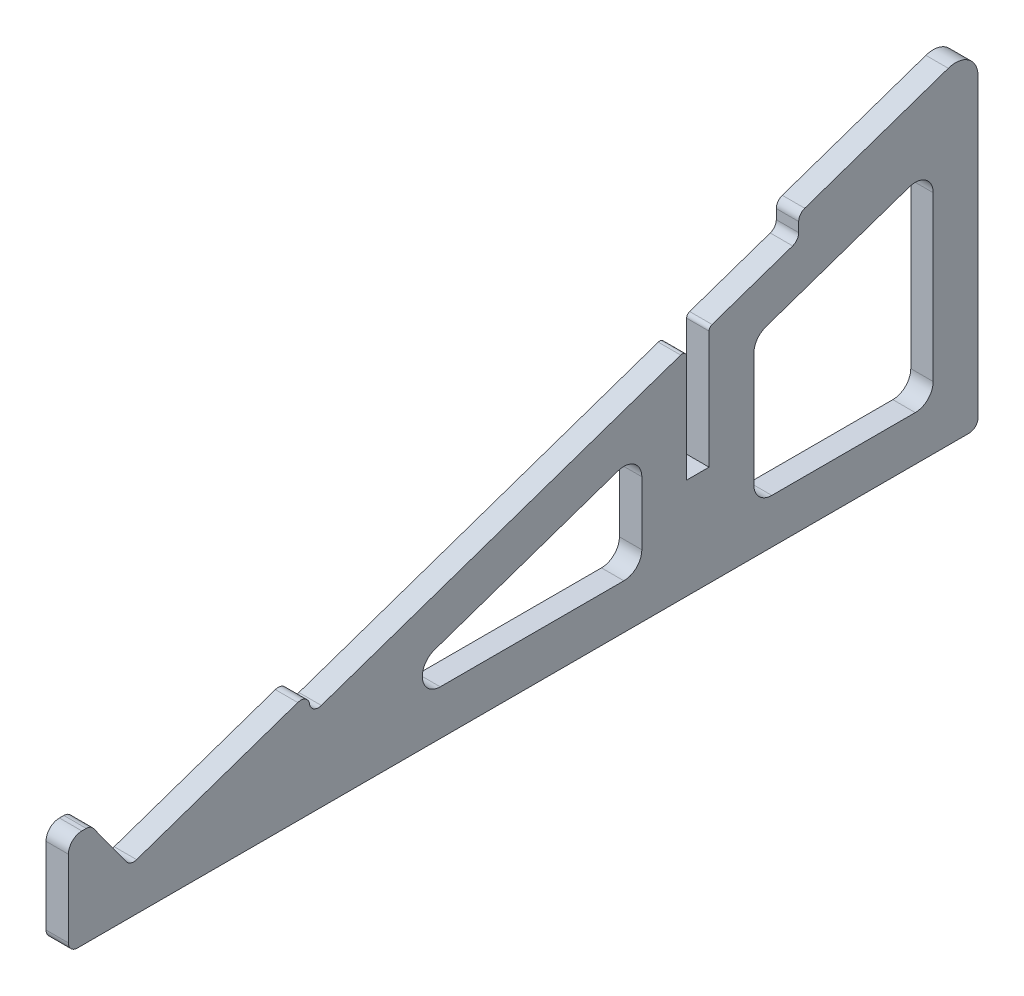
ISO-10303-21;
HEADER;
FILE_DESCRIPTION(('STEP AP214'),'2;1');
FILE_NAME('part.step','',(''),(''),'','','');
FILE_SCHEMA(('AUTOMOTIVE_DESIGN { 1 0 10303 214 1 1 1 1 }'));
ENDSEC;
DATA;
#1=APPLICATION_CONTEXT('core data for automotive mechanical design processes');
#2=APPLICATION_PROTOCOL_DEFINITION('international standard','automotive_design',2000,#1);
#3=PRODUCT_CONTEXT('',#1,'mechanical');
#4=PRODUCT('Part','Part','',(#3));
#5=PRODUCT_RELATED_PRODUCT_CATEGORY('part','',(#4));
#6=PRODUCT_DEFINITION_FORMATION('','',#4);
#7=PRODUCT_DEFINITION_CONTEXT('part definition',#1,'design');
#8=PRODUCT_DEFINITION('design','',#6,#7);
#9=PRODUCT_DEFINITION_SHAPE('','',#8);
#10=(LENGTH_UNIT() NAMED_UNIT(*) SI_UNIT(.MILLI.,.METRE.));
#11=(NAMED_UNIT(*) PLANE_ANGLE_UNIT() SI_UNIT($,.RADIAN.));
#12=(NAMED_UNIT(*) SI_UNIT($,.STERADIAN.) SOLID_ANGLE_UNIT());
#13=UNCERTAINTY_MEASURE_WITH_UNIT(LENGTH_MEASURE(1.E-05),#10,'distance_accuracy_value','');
#14=(GEOMETRIC_REPRESENTATION_CONTEXT(3) GLOBAL_UNCERTAINTY_ASSIGNED_CONTEXT((#13)) GLOBAL_UNIT_ASSIGNED_CONTEXT((#10,
#11,#12)) REPRESENTATION_CONTEXT('',''));
#15=CARTESIAN_POINT('',(0.,0.,0.));
#16=DIRECTION('',(0.,0.,1.));
#17=DIRECTION('',(1.,0.,0.));
#18=AXIS2_PLACEMENT_3D('',#15,#16,#17);
#19=CARTESIAN_POINT('',(0.,71.5524684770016,-78.0545136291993));
#20=DIRECTION('',(0.,-0.945518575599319,-0.325568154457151));
#21=DIRECTION('',(0.,0.325568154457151,-0.945518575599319));
#22=AXIS2_PLACEMENT_3D('',#19,#20,#21);
#23=PLANE('',#22);
#24=DIRECTION('',(0.,0.325568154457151,-0.945518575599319));
#25=VECTOR('',#24,1.);
#26=CARTESIAN_POINT('',(0.,71.5524684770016,-78.0545136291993));
#27=LINE('',#26,#25);
#28=CARTESIAN_POINT('',(0.,63.1014734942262,-53.5110420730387));
#29=VERTEX_POINT('',#28);
#30=CARTESIAN_POINT('',(0.,70.9626156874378,-76.3414567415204));
#31=VERTEX_POINT('',#30);
#32=EDGE_CURVE('E323',#29,#31,#27,.T.);
#33=ORIENTED_EDGE('',*,*,#32,.F.);
#34=DIRECTION('',(1.,0.,0.));
#35=VECTOR('',#34,1.);
#36=CARTESIAN_POINT('',(0.,63.1014734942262,-53.5110420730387));
#37=LINE('',#36,#35);
#38=CARTESIAN_POINT('',(6.35,63.1014734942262,-53.5110420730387));
#39=VERTEX_POINT('',#38);
#40=EDGE_CURVE('E521',#29,#39,#37,.T.);
#41=ORIENTED_EDGE('',*,*,#40,.T.);
#42=DIRECTION('',(0.,0.325568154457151,-0.945518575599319));
#43=VECTOR('',#42,1.);
#44=CARTESIAN_POINT('',(6.35,71.5524684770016,-78.0545136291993));
#45=LINE('',#44,#43);
#46=CARTESIAN_POINT('',(6.35,70.9626156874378,-76.3414567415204));
#47=VERTEX_POINT('',#46);
#48=EDGE_CURVE('E318',#39,#47,#45,.T.);
#49=ORIENTED_EDGE('',*,*,#48,.T.);
#50=DIRECTION('',(1.,0.,0.));
#51=VECTOR('',#50,1.);
#52=CARTESIAN_POINT('',(0.,70.9626156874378,-76.3414567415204));
#53=LINE('',#52,#51);
#54=EDGE_CURVE('E422',#47,#31,#53,.F.);
#55=ORIENTED_EDGE('',*,*,#54,.T.);
#56=EDGE_LOOP('',(#33,#41,#49,#55));
#57=FACE_BOUND('',#56,.T.);
#58=ADVANCED_FACE('F35',(#57),#23,.F.);
#59=CARTESIAN_POINT('',(6.35,95.3943112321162,-128.854513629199));
#60=DIRECTION('',(0.,-0.945518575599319,-0.32556815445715));
#61=DIRECTION('',(0.,0.32556815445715,-0.945518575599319));
#62=AXIS2_PLACEMENT_3D('',#59,#60,#61);
#63=PLANE('',#62);
#64=DIRECTION('',(0.,-0.32556815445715,0.945518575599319));
#65=VECTOR('',#64,1.);
#66=CARTESIAN_POINT('',(6.35,95.3943112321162,-128.854513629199));
#67=LINE('',#66,#65);
#68=CARTESIAN_POINT('',(6.35,92.4959825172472,-120.437155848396));
#69=VERTEX_POINT('',#68);
#70=CARTESIAN_POINT('',(6.35,78.4923212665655,-79.7675705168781));
#71=VERTEX_POINT('',#70);
#72=EDGE_CURVE('E340',#69,#71,#67,.T.);
#73=ORIENTED_EDGE('',*,*,#72,.F.);
#74=DIRECTION('',(-1.,0.,0.));
#75=VECTOR('',#74,1.);
#76=CARTESIAN_POINT('',(6.35,92.4959825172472,-120.437155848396));
#77=LINE('',#76,#75);
#78=CARTESIAN_POINT('',(0.,92.4959825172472,-120.437155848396));
#79=VERTEX_POINT('',#78);
#80=EDGE_CURVE('E449',#69,#79,#77,.T.);
#81=ORIENTED_EDGE('',*,*,#80,.T.);
#82=DIRECTION('',(0.,-0.32556815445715,0.945518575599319));
#83=VECTOR('',#82,1.);
#84=CARTESIAN_POINT('',(0.,95.3943112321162,-128.854513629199));
#85=LINE('',#84,#83);
#86=CARTESIAN_POINT('',(0.,78.4923212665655,-79.7675705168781));
#87=VERTEX_POINT('',#86);
#88=EDGE_CURVE('E357',#79,#87,#85,.T.);
#89=ORIENTED_EDGE('',*,*,#88,.T.);
#90=DIRECTION('',(1.,0.,0.));
#91=VECTOR('',#90,1.);
#92=CARTESIAN_POINT('',(6.35,78.4923212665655,-79.7675705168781));
#93=LINE('',#92,#91);
#94=EDGE_CURVE('E348',#87,#71,#93,.T.);
#95=ORIENTED_EDGE('',*,*,#94,.T.);
#96=EDGE_LOOP('',(#73,#81,#89,#95));
#97=FACE_BOUND('',#96,.T.);
#98=ADVANCED_FACE('F566',(#97),#63,.F.);
#99=CARTESIAN_POINT('',(6.35,0.,128.854513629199));
#100=DIRECTION('',(0.,0.,-1.));
#101=DIRECTION('',(0.,1.,0.));
#102=AXIS2_PLACEMENT_3D('',#99,#100,#101);
#103=PLANE('',#102);
#104=DIRECTION('',(0.,-1.,0.));
#105=VECTOR('',#104,1.);
#106=CARTESIAN_POINT('',(6.35,0.,128.854513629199));
#107=LINE('',#106,#105);
#108=CARTESIAN_POINT('',(6.35,24.3017737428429,128.854513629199));
#109=VERTEX_POINT('',#108);
#110=CARTESIAN_POINT('',(6.35,2.54,128.854513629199));
#111=VERTEX_POINT('',#110);
#112=EDGE_CURVE('E330',#109,#111,#107,.T.);
#113=ORIENTED_EDGE('',*,*,#112,.F.);
#114=DIRECTION('',(-1.,0.,0.));
#115=VECTOR('',#114,1.);
#116=CARTESIAN_POINT('',(6.35,24.3017737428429,128.854513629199));
#117=LINE('',#116,#115);
#118=CARTESIAN_POINT('',(0.,24.3017737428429,128.854513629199));
#119=VERTEX_POINT('',#118);
#120=EDGE_CURVE('E440',#109,#119,#117,.T.);
#121=ORIENTED_EDGE('',*,*,#120,.T.);
#122=DIRECTION('',(0.,-1.,0.));
#123=VECTOR('',#122,1.);
#124=CARTESIAN_POINT('',(0.,0.,128.854513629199));
#125=LINE('',#124,#123);
#126=CARTESIAN_POINT('',(0.,2.54,128.854513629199));
#127=VERTEX_POINT('',#126);
#128=EDGE_CURVE('E325',#119,#127,#125,.T.);
#129=ORIENTED_EDGE('',*,*,#128,.T.);
#130=DIRECTION('',(-1.,0.,0.));
#131=VECTOR('',#130,1.);
#132=CARTESIAN_POINT('',(6.35,2.54,128.854513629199));
#133=LINE('',#132,#131);
#134=EDGE_CURVE('E403',#127,#111,#133,.F.);
#135=ORIENTED_EDGE('',*,*,#134,.T.);
#136=EDGE_LOOP('',(#113,#121,#129,#135));
#137=FACE_BOUND('',#136,.T.);
#138=ADVANCED_FACE('F593',(#137),#103,.F.);
#139=CARTESIAN_POINT('',(6.35,0.,128.854513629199));
#140=DIRECTION('',(0.,1.,0.));
#141=DIRECTION('',(0.,0.,1.));
#142=AXIS2_PLACEMENT_3D('',#139,#140,#141);
#143=PLANE('',#142);
#144=DIRECTION('',(0.,0.,-1.));
#145=VECTOR('',#144,1.);
#146=CARTESIAN_POINT('',(0.,0.,128.854513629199));
#147=LINE('',#146,#145);
#148=CARTESIAN_POINT('',(0.,0.,126.314513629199));
#149=VERTEX_POINT('',#148);
#150=CARTESIAN_POINT('',(0.,0.,-126.314513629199));
#151=VERTEX_POINT('',#150);
#152=EDGE_CURVE('E350',#149,#151,#147,.T.);
#153=ORIENTED_EDGE('',*,*,#152,.T.);
#154=DIRECTION('',(-1.,0.,0.));
#155=VECTOR('',#154,1.);
#156=CARTESIAN_POINT('',(6.35,0.,-126.314513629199));
#157=LINE('',#156,#155);
#158=CARTESIAN_POINT('',(6.35,0.,-126.314513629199));
#159=VERTEX_POINT('',#158);
#160=EDGE_CURVE('E395',#151,#159,#157,.F.);
#161=ORIENTED_EDGE('',*,*,#160,.T.);
#162=DIRECTION('',(0.,0.,-1.));
#163=VECTOR('',#162,1.);
#164=CARTESIAN_POINT('',(6.35,0.,128.854513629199));
#165=LINE('',#164,#163);
#166=CARTESIAN_POINT('',(6.35,0.,126.314513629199));
#167=VERTEX_POINT('',#166);
#168=EDGE_CURVE('E332',#167,#159,#165,.T.);
#169=ORIENTED_EDGE('',*,*,#168,.F.);
#170=DIRECTION('',(-1.,0.,0.));
#171=VECTOR('',#170,1.);
#172=CARTESIAN_POINT('',(6.35,0.,126.314513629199));
#173=LINE('',#172,#171);
#174=EDGE_CURVE('E392',#167,#149,#173,.T.);
#175=ORIENTED_EDGE('',*,*,#174,.T.);
#176=EDGE_LOOP('',(#153,#161,#169,#175));
#177=FACE_BOUND('',#176,.T.);
#178=ADVANCED_FACE('F583',(#177),#143,.F.);
#179=CARTESIAN_POINT('',(6.35,0.,-128.854513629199));
#180=DIRECTION('',(0.,0.,1.));
#181=DIRECTION('',(0.,-1.,0.));
#182=AXIS2_PLACEMENT_3D('',#179,#180,#181);
#183=PLANE('',#182);
#184=DIRECTION('',(0.,1.,0.));
#185=VECTOR('',#184,1.);
#186=CARTESIAN_POINT('',(0.,0.,-128.854513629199));
#187=LINE('',#186,#185);
#188=CARTESIAN_POINT('',(0.,2.54,-128.854513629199));
#189=VERTEX_POINT('',#188);
#190=CARTESIAN_POINT('',(0.,86.4919395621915,-128.854513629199));
#191=VERTEX_POINT('',#190);
#192=EDGE_CURVE('E353',#189,#191,#187,.T.);
#193=ORIENTED_EDGE('',*,*,#192,.T.);
#194=DIRECTION('',(-1.,0.,0.));
#195=VECTOR('',#194,1.);
#196=CARTESIAN_POINT('',(6.35,86.4919395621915,-128.854513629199));
#197=LINE('',#196,#195);
#198=CARTESIAN_POINT('',(6.35,86.4919395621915,-128.854513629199));
#199=VERTEX_POINT('',#198);
#200=EDGE_CURVE('E454',#191,#199,#197,.F.);
#201=ORIENTED_EDGE('',*,*,#200,.T.);
#202=DIRECTION('',(0.,1.,0.));
#203=VECTOR('',#202,1.);
#204=CARTESIAN_POINT('',(6.35,0.,-128.854513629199));
#205=LINE('',#204,#203);
#206=CARTESIAN_POINT('',(6.35,2.54,-128.854513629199));
#207=VERTEX_POINT('',#206);
#208=EDGE_CURVE('E336',#207,#199,#205,.T.);
#209=ORIENTED_EDGE('',*,*,#208,.F.);
#210=DIRECTION('',(-1.,0.,0.));
#211=VECTOR('',#210,1.);
#212=CARTESIAN_POINT('',(6.35,2.54,-128.854513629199));
#213=LINE('',#212,#211);
#214=EDGE_CURVE('E382',#207,#189,#213,.T.);
#215=ORIENTED_EDGE('',*,*,#214,.T.);
#216=EDGE_LOOP('',(#193,#201,#209,#215));
#217=FACE_BOUND('',#216,.T.);
#218=ADVANCED_FACE('F574',(#217),#183,.F.);
#219=CARTESIAN_POINT('',(0.,29.032511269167,63.874147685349));
#220=VERTEX_POINT('',#219);
#221=CARTESIAN_POINT('',(0.,13.3119057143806,109.530101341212));
#222=VERTEX_POINT('',#221);
#223=EDGE_CURVE('E356',#220,#222,#85,.T.);
#224=ORIENTED_EDGE('',*,*,#223,.T.);
#225=DIRECTION('',(-1.,0.,0.));
#226=VECTOR('',#225,1.);
#227=CARTESIAN_POINT('',(6.35,13.3119057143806,109.530101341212));
#228=LINE('',#227,#226);
#229=CARTESIAN_POINT('',(6.35,13.3119057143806,109.530101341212));
#230=VERTEX_POINT('',#229);
#231=EDGE_CURVE('E414',#222,#230,#228,.F.);
#232=ORIENTED_EDGE('',*,*,#231,.T.);
#233=CARTESIAN_POINT('',(6.35,29.032511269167,63.874147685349));
#234=VERTEX_POINT('',#233);
#235=EDGE_CURVE('E339',#234,#230,#67,.T.);
#236=ORIENTED_EDGE('',*,*,#235,.F.);
#237=DIRECTION('',(1.,0.,0.));
#238=VECTOR('',#237,1.);
#239=CARTESIAN_POINT('',(6.35,29.032511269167,63.8741476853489));
#240=LINE('',#239,#238);
#241=EDGE_CURVE('E380',#234,#220,#240,.F.);
#242=ORIENTED_EDGE('',*,*,#241,.T.);
#243=EDGE_LOOP('',(#224,#232,#236,#242));
#244=FACE_BOUND('',#243,.T.);
#245=ADVANCED_FACE('F620',(#244),#63,.F.);
#246=CARTESIAN_POINT('',(6.35,12.7,111.307204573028));
#247=DIRECTION('',(0.,-0.587785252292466,0.809016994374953));
#248=DIRECTION('',(0.,-0.809016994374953,-0.587785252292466));
#249=AXIS2_PLACEMENT_3D('',#246,#247,#248);
#250=PLANE('',#249);
#251=DIRECTION('',(0.,0.809016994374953,0.587785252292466));
#252=VECTOR('',#251,1.);
#253=CARTESIAN_POINT('',(0.,12.7,111.307204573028));
#254=LINE('',#253,#252);
#255=CARTESIAN_POINT('',(0.,14.22054835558,112.411947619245));
#256=VERTEX_POINT('',#255);
#257=CARTESIAN_POINT('',(0.,27.0647482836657,121.743805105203));
#258=VERTEX_POINT('',#257);
#259=EDGE_CURVE('E359',#256,#258,#254,.T.);
#260=ORIENTED_EDGE('',*,*,#259,.T.);
#261=DIRECTION('',(-1.,0.,0.));
#262=VECTOR('',#261,1.);
#263=CARTESIAN_POINT('',(6.35,27.0647482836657,121.743805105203));
#264=LINE('',#263,#262);
#265=CARTESIAN_POINT('',(6.35,27.0647482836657,121.743805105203));
#266=VERTEX_POINT('',#265);
#267=EDGE_CURVE('E412',#258,#266,#264,.F.);
#268=ORIENTED_EDGE('',*,*,#267,.T.);
#269=DIRECTION('',(0.,0.809016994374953,0.587785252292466));
#270=VECTOR('',#269,1.);
#271=CARTESIAN_POINT('',(6.35,12.7,111.307204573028));
#272=LINE('',#271,#270);
#273=CARTESIAN_POINT('',(6.35,14.22054835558,112.411947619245));
#274=VERTEX_POINT('',#273);
#275=EDGE_CURVE('E342',#274,#266,#272,.T.);
#276=ORIENTED_EDGE('',*,*,#275,.F.);
#277=DIRECTION('',(-1.,0.,0.));
#278=VECTOR('',#277,1.);
#279=CARTESIAN_POINT('',(0.,14.22054835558,112.411947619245));
#280=LINE('',#279,#278);
#281=EDGE_CURVE('E409',#274,#256,#280,.T.);
#282=ORIENTED_EDGE('',*,*,#281,.T.);
#283=EDGE_LOOP('',(#260,#268,#276,#282));
#284=FACE_BOUND('',#283,.T.);
#285=ADVANCED_FACE('F610',(#284),#250,.F.);
#286=CARTESIAN_POINT('',(6.35,28.1117737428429,122.504513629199));
#287=DIRECTION('',(0.,-1.,0.));
#288=DIRECTION('',(0.,0.,-1.));
#289=AXIS2_PLACEMENT_3D('',#286,#287,#288);
#290=PLANE('',#289);
#291=DIRECTION('',(0.,0.,1.));
#292=VECTOR('',#291,1.);
#293=CARTESIAN_POINT('',(0.,28.1117737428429,122.504513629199));
#294=LINE('',#293,#292);
#295=CARTESIAN_POINT('',(0.,28.1117737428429,123.798708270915));
#296=VERTEX_POINT('',#295);
#297=CARTESIAN_POINT('',(0.,28.1117737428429,125.044513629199));
#298=VERTEX_POINT('',#297);
#299=EDGE_CURVE('E333',#296,#298,#294,.T.);
#300=ORIENTED_EDGE('',*,*,#299,.T.);
#301=DIRECTION('',(-1.,0.,0.));
#302=VECTOR('',#301,1.);
#303=CARTESIAN_POINT('',(6.35,28.1117737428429,125.044513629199));
#304=LINE('',#303,#302);
#305=CARTESIAN_POINT('',(6.35,28.1117737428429,125.044513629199));
#306=VERTEX_POINT('',#305);
#307=EDGE_CURVE('E445',#298,#306,#304,.F.);
#308=ORIENTED_EDGE('',*,*,#307,.T.);
#309=DIRECTION('',(0.,0.,1.));
#310=VECTOR('',#309,1.);
#311=CARTESIAN_POINT('',(6.35,28.1117737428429,122.504513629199));
#312=LINE('',#311,#310);
#313=CARTESIAN_POINT('',(6.35,28.1117737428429,123.798708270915));
#314=VERTEX_POINT('',#313);
#315=EDGE_CURVE('E345',#314,#306,#312,.T.);
#316=ORIENTED_EDGE('',*,*,#315,.F.);
#317=DIRECTION('',(-1.,0.,0.));
#318=VECTOR('',#317,1.);
#319=CARTESIAN_POINT('',(6.35,28.1117737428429,123.798708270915));
#320=LINE('',#319,#318);
#321=EDGE_CURVE('E406',#314,#296,#320,.T.);
#322=ORIENTED_EDGE('',*,*,#321,.T.);
#323=EDGE_LOOP('',(#300,#308,#316,#322));
#324=FACE_BOUND('',#323,.T.);
#325=ADVANCED_FACE('F601',(#324),#290,.F.);
#326=CARTESIAN_POINT('',(6.35,0.,0.));
#327=DIRECTION('',(1.,0.,0.));
#328=DIRECTION('',(0.,0.,-1.));
#329=AXIS2_PLACEMENT_3D('',#326,#327,#328);
#330=PLANE('',#329);
#331=DIRECTION('',(0.,-0.325568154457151,0.945518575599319));
#332=VECTOR('',#331,1.);
#333=CARTESIAN_POINT('',(6.35,12.7,53.8567362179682));
#334=LINE('',#333,#332);
#335=CARTESIAN_POINT('',(6.35,40.4966604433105,-26.870627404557));
#336=VERTEX_POINT('',#335);
#337=CARTESIAN_POINT('',(6.35,22.5832343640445,25.1537394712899));
#338=VERTEX_POINT('',#337);
#339=EDGE_CURVE('E719',#336,#338,#334,.T.);
#340=ORIENTED_EDGE('',*,*,#339,.F.);
#341=CARTESIAN_POINT('',(6.35,35.6934260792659,-28.5245136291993));
#342=DIRECTION('',(1.,0.,0.));
#343=DIRECTION('',(0.,0.,-1.));
#344=AXIS2_PLACEMENT_3D('',#341,#342,#343);
#345=CIRCLE('',#344,5.08);
#346=CARTESIAN_POINT('',(6.35,35.6934260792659,-33.6045136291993));
#347=VERTEX_POINT('',#346);
#348=EDGE_CURVE('E517',#336,#347,#345,.F.);
#349=ORIENTED_EDGE('',*,*,#348,.T.);
#350=DIRECTION('',(0.,1.,0.));
#351=VECTOR('',#350,1.);
#352=CARTESIAN_POINT('',(6.35,42.8153234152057,-33.6045136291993));
#353=LINE('',#352,#351);
#354=CARTESIAN_POINT('',(6.35,17.78,-33.6045136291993));
#355=VERTEX_POINT('',#354);
#356=EDGE_CURVE('E715',#355,#347,#353,.T.);
#357=ORIENTED_EDGE('',*,*,#356,.F.);
#358=CARTESIAN_POINT('',(6.35,17.78,-28.5245136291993));
#359=DIRECTION('',(1.,0.,0.));
#360=DIRECTION('',(0.,0.,-1.));
#361=AXIS2_PLACEMENT_3D('',#358,#359,#360);
#362=CIRCLE('',#361,5.08);
#363=CARTESIAN_POINT('',(6.35,12.7,-28.5245136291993));
#364=VERTEX_POINT('',#363);
#365=EDGE_CURVE('E501',#355,#364,#362,.F.);
#366=ORIENTED_EDGE('',*,*,#365,.T.);
#367=DIRECTION('',(0.,0.,-1.));
#368=VECTOR('',#367,1.);
#369=CARTESIAN_POINT('',(6.35,12.7,-33.6045136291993));
#370=LINE('',#369,#368);
#371=CARTESIAN_POINT('',(6.35,12.7,23.4998532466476));
#372=VERTEX_POINT('',#371);
#373=EDGE_CURVE('E714',#372,#364,#370,.T.);
#374=ORIENTED_EDGE('',*,*,#373,.F.);
#375=CARTESIAN_POINT('',(6.35,17.78,23.4998532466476));
#376=DIRECTION('',(1.,0.,0.));
#377=DIRECTION('',(0.,0.,-1.));
#378=AXIS2_PLACEMENT_3D('',#375,#376,#377);
#379=CIRCLE('',#378,5.08);
#380=EDGE_CURVE('E509',#372,#338,#379,.F.);
#381=ORIENTED_EDGE('',*,*,#380,.T.);
#382=EDGE_LOOP('',(#340,#349,#357,#366,#374,#381));
#383=FACE_BOUND('',#382,.T.);
#384=DIRECTION('',(0.,-0.325568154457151,0.945518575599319));
#385=VECTOR('',#384,1.);
#386=CARTESIAN_POINT('',(6.35,71.2395678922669,-116.154513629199));
#387=LINE('',#386,#385);
#388=CARTESIAN_POINT('',(6.35,68.9209049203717,-109.420627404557));
#389=VERTEX_POINT('',#388);
#390=CARTESIAN_POINT('',(6.35,54.92743071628,-68.780627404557));
#391=VERTEX_POINT('',#390);
#392=EDGE_CURVE('E702',#389,#391,#387,.T.);
#393=ORIENTED_EDGE('',*,*,#392,.F.);
#394=CARTESIAN_POINT('',(6.35,64.1176705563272,-111.074513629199));
#395=DIRECTION('',(1.,0.,0.));
#396=DIRECTION('',(0.,0.,-1.));
#397=AXIS2_PLACEMENT_3D('',#394,#395,#396);
#398=CIRCLE('',#397,5.08);
#399=CARTESIAN_POINT('',(6.35,64.1176705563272,-116.154513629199));
#400=VERTEX_POINT('',#399);
#401=EDGE_CURVE('E513',#389,#400,#398,.F.);
#402=ORIENTED_EDGE('',*,*,#401,.T.);
#403=DIRECTION('',(0.,1.,0.));
#404=VECTOR('',#403,1.);
#405=CARTESIAN_POINT('',(6.35,12.7,-116.154513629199));
#406=LINE('',#405,#404);
#407=CARTESIAN_POINT('',(6.35,17.78,-116.154513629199));
#408=VERTEX_POINT('',#407);
#409=EDGE_CURVE('E730',#408,#400,#406,.T.);
#410=ORIENTED_EDGE('',*,*,#409,.F.);
#411=CARTESIAN_POINT('',(6.35,17.78,-111.074513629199));
#412=DIRECTION('',(1.,0.,0.));
#413=DIRECTION('',(0.,0.,-1.));
#414=AXIS2_PLACEMENT_3D('',#411,#412,#413);
#415=CIRCLE('',#414,5.08);
#416=CARTESIAN_POINT('',(6.35,12.7,-111.074513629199));
#417=VERTEX_POINT('',#416);
#418=EDGE_CURVE('E497',#408,#417,#415,.F.);
#419=ORIENTED_EDGE('',*,*,#418,.T.);
#420=DIRECTION('',(0.,0.,-1.));
#421=VECTOR('',#420,1.);
#422=CARTESIAN_POINT('',(6.35,12.7,-65.3545136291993));
#423=LINE('',#422,#421);
#424=CARTESIAN_POINT('',(6.35,12.7,-70.4345136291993));
#425=VERTEX_POINT('',#424);
#426=EDGE_CURVE('E743',#425,#417,#423,.T.);
#427=ORIENTED_EDGE('',*,*,#426,.F.);
#428=CARTESIAN_POINT('',(6.35,17.78,-70.4345136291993));
#429=DIRECTION('',(1.,0.,0.));
#430=DIRECTION('',(0.,0.,-1.));
#431=AXIS2_PLACEMENT_3D('',#428,#429,#430);
#432=CIRCLE('',#431,5.08);
#433=CARTESIAN_POINT('',(6.35,17.78,-65.3545136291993));
#434=VERTEX_POINT('',#433);
#435=EDGE_CURVE('E505',#425,#434,#432,.F.);
#436=ORIENTED_EDGE('',*,*,#435,.T.);
#437=DIRECTION('',(0.,-1.,0.));
#438=VECTOR('',#437,1.);
#439=CARTESIAN_POINT('',(6.35,53.7477251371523,-65.3545136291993));
#440=LINE('',#439,#438);
#441=CARTESIAN_POINT('',(6.35,50.1241963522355,-65.3545136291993));
#442=VERTEX_POINT('',#441);
#443=EDGE_CURVE('E740',#442,#434,#440,.T.);
#444=ORIENTED_EDGE('',*,*,#443,.F.);
#445=CARTESIAN_POINT('',(6.35,50.1241963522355,-70.4345136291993));
#446=DIRECTION('',(1.,0.,0.));
#447=DIRECTION('',(0.,0.,-1.));
#448=AXIS2_PLACEMENT_3D('',#445,#446,#447);
#449=CIRCLE('',#448,5.08);
#450=EDGE_CURVE('E493',#442,#391,#449,.F.);
#451=ORIENTED_EDGE('',*,*,#450,.T.);
#452=EDGE_LOOP('',(#393,#402,#410,#419,#427,#436,#444,#451));
#453=FACE_BOUND('',#452,.T.);
#454=ORIENTED_EDGE('',*,*,#48,.F.);
#455=CARTESIAN_POINT('',(6.35,61.9006649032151,-53.9245136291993));
#456=DIRECTION('',(1.,0.,0.));
#457=DIRECTION('',(0.,0.,-1.));
#458=AXIS2_PLACEMENT_3D('',#455,#456,#457);
#459=CIRCLE('',#458,1.27);
#460=CARTESIAN_POINT('',(6.35,61.9006649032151,-52.6545136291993));
#461=VERTEX_POINT('',#460);
#462=EDGE_CURVE('E526',#39,#461,#459,.T.);
#463=ORIENTED_EDGE('',*,*,#462,.T.);
#464=DIRECTION('',(0.,1.,0.));
#465=VECTOR('',#464,1.);
#466=CARTESIAN_POINT('',(6.35,62.8065470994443,-52.6545136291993));
#467=LINE('',#466,#465);
#468=CARTESIAN_POINT('',(6.35,28.5165470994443,-52.6545136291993));
#469=VERTEX_POINT('',#468);
#470=EDGE_CURVE('E293',#469,#461,#467,.T.);
#471=ORIENTED_EDGE('',*,*,#470,.F.);
#472=DIRECTION('',(0.,0.,-1.));
#473=VECTOR('',#472,1.);
#474=CARTESIAN_POINT('',(6.35,28.5165470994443,-52.6545136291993));
#475=LINE('',#474,#473);
#476=CARTESIAN_POINT('',(6.35,28.5165470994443,-46.3045136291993));
#477=VERTEX_POINT('',#476);
#478=EDGE_CURVE('E313',#477,#469,#475,.T.);
#479=ORIENTED_EDGE('',*,*,#478,.F.);
#480=DIRECTION('',(0.,-1.,0.));
#481=VECTOR('',#480,1.);
#482=CARTESIAN_POINT('',(6.35,28.5165470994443,-46.3045136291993));
#483=LINE('',#482,#481);
#484=CARTESIAN_POINT('',(6.35,58.8395924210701,-46.3045136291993));
#485=VERTEX_POINT('',#484);
#486=EDGE_CURVE('E299',#485,#477,#483,.T.);
#487=ORIENTED_EDGE('',*,*,#486,.F.);
#488=CARTESIAN_POINT('',(6.35,58.8395924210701,-45.0345136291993));
#489=DIRECTION('',(1.,0.,0.));
#490=DIRECTION('',(0.,0.,-1.));
#491=AXIS2_PLACEMENT_3D('',#488,#489,#490);
#492=CIRCLE('',#491,1.27);
#493=CARTESIAN_POINT('',(6.35,60.0404010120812,-44.6210420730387));
#494=VERTEX_POINT('',#493);
#495=EDGE_CURVE('E524',#485,#494,#492,.T.);
#496=ORIENTED_EDGE('',*,*,#495,.T.);
#497=CARTESIAN_POINT('',(6.35,24.9818721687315,57.196318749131));
#498=VERTEX_POINT('',#497);
#499=EDGE_CURVE('E326',#498,#494,#45,.T.);
#500=ORIENTED_EDGE('',*,*,#499,.F.);
#501=CARTESIAN_POINT('',(6.35,27.3834893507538,58.0232618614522));
#502=DIRECTION('',(1.,0.,0.));
#503=DIRECTION('',(0.,0.,-1.));
#504=AXIS2_PLACEMENT_3D('',#501,#502,#503);
#505=CIRCLE('',#504,2.54);
#506=CARTESIAN_POINT('',(6.35,27.0071917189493,60.53523321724));
#507=VERTEX_POINT('',#506);
#508=EDGE_CURVE('E436',#498,#507,#505,.F.);
#509=ORIENTED_EDGE('',*,*,#508,.T.);
#510=CARTESIAN_POINT('',(6.35,26.6308940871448,63.0472045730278));
#511=DIRECTION('',(1.,0.,0.));
#512=DIRECTION('',(0.,0.,-1.));
#513=AXIS2_PLACEMENT_3D('',#510,#511,#512);
#514=CIRCLE('',#513,2.54);
#515=EDGE_CURVE('E366',#507,#234,#514,.T.);
#516=ORIENTED_EDGE('',*,*,#515,.T.);
#517=ORIENTED_EDGE('',*,*,#235,.T.);
#518=CARTESIAN_POINT('',(6.35,15.7135228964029,110.357044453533));
#519=DIRECTION('',(1.,0.,0.));
#520=DIRECTION('',(0.,0.,-1.));
#521=AXIS2_PLACEMENT_3D('',#518,#519,#520);
#522=CIRCLE('',#521,2.54);
#523=EDGE_CURVE('E429',#230,#274,#522,.F.);
#524=ORIENTED_EDGE('',*,*,#523,.T.);
#525=ORIENTED_EDGE('',*,*,#275,.T.);
#526=CARTESIAN_POINT('',(6.35,25.5717737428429,123.798708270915));
#527=DIRECTION('',(1.,0.,0.));
#528=DIRECTION('',(0.,0.,-1.));
#529=AXIS2_PLACEMENT_3D('',#526,#527,#528);
#530=CIRCLE('',#529,2.54);
#531=EDGE_CURVE('E397',#266,#314,#530,.T.);
#532=ORIENTED_EDGE('',*,*,#531,.T.);
#533=ORIENTED_EDGE('',*,*,#315,.T.);
#534=CARTESIAN_POINT('',(6.35,24.3017737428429,125.044513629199));
#535=DIRECTION('',(1.,0.,0.));
#536=DIRECTION('',(0.,0.,-1.));
#537=AXIS2_PLACEMENT_3D('',#534,#535,#536);
#538=CIRCLE('',#537,3.81);
#539=EDGE_CURVE('E447',#306,#109,#538,.T.);
#540=ORIENTED_EDGE('',*,*,#539,.T.);
#541=ORIENTED_EDGE('',*,*,#112,.T.);
#542=CARTESIAN_POINT('',(6.35,2.54,126.314513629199));
#543=DIRECTION('',(1.,0.,0.));
#544=DIRECTION('',(0.,0.,-1.));
#545=AXIS2_PLACEMENT_3D('',#542,#543,#544);
#546=CIRCLE('',#545,2.54);
#547=EDGE_CURVE('E399',#111,#167,#546,.T.);
#548=ORIENTED_EDGE('',*,*,#547,.T.);
#549=ORIENTED_EDGE('',*,*,#168,.T.);
#550=CARTESIAN_POINT('',(6.35,2.54,-126.314513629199));
#551=DIRECTION('',(1.,0.,0.));
#552=DIRECTION('',(0.,0.,-1.));
#553=AXIS2_PLACEMENT_3D('',#550,#551,#552);
#554=CIRCLE('',#553,2.54);
#555=EDGE_CURVE('E401',#159,#207,#554,.T.);
#556=ORIENTED_EDGE('',*,*,#555,.T.);
#557=ORIENTED_EDGE('',*,*,#208,.T.);
#558=CARTESIAN_POINT('',(6.35,86.4919395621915,-122.504513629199));
#559=DIRECTION('',(1.,0.,0.));
#560=DIRECTION('',(0.,0.,-1.));
#561=AXIS2_PLACEMENT_3D('',#558,#559,#560);
#562=CIRCLE('',#561,6.35);
#563=EDGE_CURVE('E456',#199,#69,#562,.T.);
#564=ORIENTED_EDGE('',*,*,#563,.T.);
#565=ORIENTED_EDGE('',*,*,#72,.T.);
#566=CARTESIAN_POINT('',(6.35,76.0907040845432,-80.5945136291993));
#567=DIRECTION('',(1.,0.,0.));
#568=DIRECTION('',(0.,0.,-1.));
#569=AXIS2_PLACEMENT_3D('',#566,#567,#568);
#570=CIRCLE('',#569,2.54);
#571=CARTESIAN_POINT('',(6.35,76.0907040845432,-78.0545136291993));
#572=VERTEX_POINT('',#571);
#573=EDGE_CURVE('E368',#71,#572,#570,.T.);
#574=ORIENTED_EDGE('',*,*,#573,.T.);
#575=DIRECTION('',(0.,1.,0.));
#576=VECTOR('',#575,1.);
#577=CARTESIAN_POINT('',(6.35,77.9024684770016,-78.0545136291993));
#578=LINE('',#577,#576);
#579=CARTESIAN_POINT('',(6.35,73.3642328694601,-78.0545136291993));
#580=VERTEX_POINT('',#579);
#581=EDGE_CURVE('E328',#580,#572,#578,.T.);
#582=ORIENTED_EDGE('',*,*,#581,.F.);
#583=CARTESIAN_POINT('',(6.35,73.3642328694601,-75.5145136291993));
#584=DIRECTION('',(1.,0.,0.));
#585=DIRECTION('',(0.,0.,-1.));
#586=AXIS2_PLACEMENT_3D('',#583,#584,#585);
#587=CIRCLE('',#586,2.54);
#588=EDGE_CURVE('E431',#580,#47,#587,.F.);
#589=ORIENTED_EDGE('',*,*,#588,.T.);
#590=EDGE_LOOP('',(#454,#463,#471,#479,#487,#496,#500,#509,#516,#517,#524,#525,#532,#533,#540,
#541,#548,#549,#556,#557,#564,#565,#574,#582,#589));
#591=FACE_BOUND('',#590,.T.);
#592=ADVANCED_FACE('F535',(#383,#453,#591),#330,.T.);
#593=CARTESIAN_POINT('',(0.,0.,0.));
#594=DIRECTION('',(1.,0.,0.));
#595=DIRECTION('',(0.,0.,-1.));
#596=AXIS2_PLACEMENT_3D('',#593,#594,#595);
#597=PLANE('',#596);
#598=DIRECTION('',(0.,0.,-1.));
#599=VECTOR('',#598,1.);
#600=CARTESIAN_POINT('',(0.,12.7,-33.6045136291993));
#601=LINE('',#600,#599);
#602=CARTESIAN_POINT('',(0.,12.7,23.4998532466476));
#603=VERTEX_POINT('',#602);
#604=CARTESIAN_POINT('',(0.,12.7,-28.5245136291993));
#605=VERTEX_POINT('',#604);
#606=EDGE_CURVE('E703',#603,#605,#601,.T.);
#607=ORIENTED_EDGE('',*,*,#606,.T.);
#608=CARTESIAN_POINT('',(0.,17.78,-28.5245136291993));
#609=DIRECTION('',(1.,0.,0.));
#610=DIRECTION('',(0.,0.,-1.));
#611=AXIS2_PLACEMENT_3D('',#608,#609,#610);
#612=CIRCLE('',#611,5.08);
#613=CARTESIAN_POINT('',(0.,17.78,-33.6045136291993));
#614=VERTEX_POINT('',#613);
#615=EDGE_CURVE('E503',#605,#614,#612,.T.);
#616=ORIENTED_EDGE('',*,*,#615,.T.);
#617=DIRECTION('',(0.,1.,0.));
#618=VECTOR('',#617,1.);
#619=CARTESIAN_POINT('',(0.,42.8153234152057,-33.6045136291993));
#620=LINE('',#619,#618);
#621=CARTESIAN_POINT('',(0.,35.6934260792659,-33.6045136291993));
#622=VERTEX_POINT('',#621);
#623=EDGE_CURVE('E696',#614,#622,#620,.T.);
#624=ORIENTED_EDGE('',*,*,#623,.T.);
#625=CARTESIAN_POINT('',(0.,35.6934260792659,-28.5245136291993));
#626=DIRECTION('',(1.,0.,0.));
#627=DIRECTION('',(0.,0.,-1.));
#628=AXIS2_PLACEMENT_3D('',#625,#626,#627);
#629=CIRCLE('',#628,5.08);
#630=CARTESIAN_POINT('',(0.,40.4966604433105,-26.870627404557));
#631=VERTEX_POINT('',#630);
#632=EDGE_CURVE('E519',#622,#631,#629,.T.);
#633=ORIENTED_EDGE('',*,*,#632,.T.);
#634=DIRECTION('',(0.,-0.325568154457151,0.945518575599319));
#635=VECTOR('',#634,1.);
#636=CARTESIAN_POINT('',(0.,12.7,53.8567362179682));
#637=LINE('',#636,#635);
#638=CARTESIAN_POINT('',(0.,22.5832343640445,25.1537394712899));
#639=VERTEX_POINT('',#638);
#640=EDGE_CURVE('E721',#631,#639,#637,.T.);
#641=ORIENTED_EDGE('',*,*,#640,.T.);
#642=CARTESIAN_POINT('',(0.,17.78,23.4998532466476));
#643=DIRECTION('',(1.,0.,0.));
#644=DIRECTION('',(0.,0.,-1.));
#645=AXIS2_PLACEMENT_3D('',#642,#643,#644);
#646=CIRCLE('',#645,5.08);
#647=EDGE_CURVE('E511',#639,#603,#646,.T.);
#648=ORIENTED_EDGE('',*,*,#647,.T.);
#649=EDGE_LOOP('',(#607,#616,#624,#633,#641,#648));
#650=FACE_BOUND('',#649,.T.);
#651=DIRECTION('',(0.,0.,-1.));
#652=VECTOR('',#651,1.);
#653=CARTESIAN_POINT('',(0.,12.7,-65.3545136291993));
#654=LINE('',#653,#652);
#655=CARTESIAN_POINT('',(0.,12.7,-70.4345136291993));
#656=VERTEX_POINT('',#655);
#657=CARTESIAN_POINT('',(0.,12.7,-111.074513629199));
#658=VERTEX_POINT('',#657);
#659=EDGE_CURVE('E733',#656,#658,#654,.T.);
#660=ORIENTED_EDGE('',*,*,#659,.T.);
#661=CARTESIAN_POINT('',(0.,17.78,-111.074513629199));
#662=DIRECTION('',(1.,0.,0.));
#663=DIRECTION('',(0.,0.,-1.));
#664=AXIS2_PLACEMENT_3D('',#661,#662,#663);
#665=CIRCLE('',#664,5.08);
#666=CARTESIAN_POINT('',(0.,17.78,-116.154513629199));
#667=VERTEX_POINT('',#666);
#668=EDGE_CURVE('E499',#658,#667,#665,.T.);
#669=ORIENTED_EDGE('',*,*,#668,.T.);
#670=DIRECTION('',(0.,1.,0.));
#671=VECTOR('',#670,1.);
#672=CARTESIAN_POINT('',(0.,12.7,-116.154513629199));
#673=LINE('',#672,#671);
#674=CARTESIAN_POINT('',(0.,64.1176705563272,-116.154513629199));
#675=VERTEX_POINT('',#674);
#676=EDGE_CURVE('E314',#667,#675,#673,.T.);
#677=ORIENTED_EDGE('',*,*,#676,.T.);
#678=CARTESIAN_POINT('',(0.,64.1176705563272,-111.074513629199));
#679=DIRECTION('',(1.,0.,0.));
#680=DIRECTION('',(0.,0.,-1.));
#681=AXIS2_PLACEMENT_3D('',#678,#679,#680);
#682=CIRCLE('',#681,5.08);
#683=CARTESIAN_POINT('',(0.,68.9209049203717,-109.420627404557));
#684=VERTEX_POINT('',#683);
#685=EDGE_CURVE('E515',#675,#684,#682,.T.);
#686=ORIENTED_EDGE('',*,*,#685,.T.);
#687=DIRECTION('',(0.,-0.325568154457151,0.945518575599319));
#688=VECTOR('',#687,1.);
#689=CARTESIAN_POINT('',(0.,71.2395678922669,-116.154513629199));
#690=LINE('',#689,#688);
#691=CARTESIAN_POINT('',(0.,54.92743071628,-68.780627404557));
#692=VERTEX_POINT('',#691);
#693=EDGE_CURVE('E726',#684,#692,#690,.T.);
#694=ORIENTED_EDGE('',*,*,#693,.T.);
#695=CARTESIAN_POINT('',(0.,50.1241963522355,-70.4345136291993));
#696=DIRECTION('',(1.,0.,0.));
#697=DIRECTION('',(0.,0.,-1.));
#698=AXIS2_PLACEMENT_3D('',#695,#696,#697);
#699=CIRCLE('',#698,5.08);
#700=CARTESIAN_POINT('',(0.,50.1241963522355,-65.3545136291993));
#701=VERTEX_POINT('',#700);
#702=EDGE_CURVE('E495',#692,#701,#699,.T.);
#703=ORIENTED_EDGE('',*,*,#702,.T.);
#704=DIRECTION('',(0.,-1.,0.));
#705=VECTOR('',#704,1.);
#706=CARTESIAN_POINT('',(0.,53.7477251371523,-65.3545136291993));
#707=LINE('',#706,#705);
#708=CARTESIAN_POINT('',(0.,17.78,-65.3545136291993));
#709=VERTEX_POINT('',#708);
#710=EDGE_CURVE('E729',#701,#709,#707,.T.);
#711=ORIENTED_EDGE('',*,*,#710,.T.);
#712=CARTESIAN_POINT('',(0.,17.78,-70.4345136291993));
#713=DIRECTION('',(1.,0.,0.));
#714=DIRECTION('',(0.,0.,-1.));
#715=AXIS2_PLACEMENT_3D('',#712,#713,#714);
#716=CIRCLE('',#715,5.08);
#717=EDGE_CURVE('E507',#709,#656,#716,.T.);
#718=ORIENTED_EDGE('',*,*,#717,.T.);
#719=EDGE_LOOP('',(#660,#669,#677,#686,#694,#703,#711,#718));
#720=FACE_BOUND('',#719,.T.);
#721=DIRECTION('',(0.,1.,0.));
#722=VECTOR('',#721,1.);
#723=CARTESIAN_POINT('',(0.,62.8065470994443,-52.6545136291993));
#724=LINE('',#723,#722);
#725=CARTESIAN_POINT('',(0.,28.5165470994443,-52.6545136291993));
#726=VERTEX_POINT('',#725);
#727=CARTESIAN_POINT('',(0.,61.9006649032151,-52.6545136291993));
#728=VERTEX_POINT('',#727);
#729=EDGE_CURVE('E304',#726,#728,#724,.T.);
#730=ORIENTED_EDGE('',*,*,#729,.T.);
#731=CARTESIAN_POINT('',(0.,61.9006649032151,-53.9245136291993));
#732=DIRECTION('',(1.,0.,0.));
#733=DIRECTION('',(0.,0.,-1.));
#734=AXIS2_PLACEMENT_3D('',#731,#732,#733);
#735=CIRCLE('',#734,1.27);
#736=EDGE_CURVE('E531',#728,#29,#735,.F.);
#737=ORIENTED_EDGE('',*,*,#736,.T.);
#738=ORIENTED_EDGE('',*,*,#32,.T.);
#739=CARTESIAN_POINT('',(0.,73.3642328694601,-75.5145136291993));
#740=DIRECTION('',(1.,0.,0.));
#741=DIRECTION('',(0.,0.,-1.));
#742=AXIS2_PLACEMENT_3D('',#739,#740,#741);
#743=CIRCLE('',#742,2.54);
#744=CARTESIAN_POINT('',(0.,73.3642328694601,-78.0545136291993));
#745=VERTEX_POINT('',#744);
#746=EDGE_CURVE('E434',#31,#745,#743,.T.);
#747=ORIENTED_EDGE('',*,*,#746,.T.);
#748=DIRECTION('',(0.,1.,0.));
#749=VECTOR('',#748,1.);
#750=CARTESIAN_POINT('',(0.,77.9024684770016,-78.0545136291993));
#751=LINE('',#750,#749);
#752=CARTESIAN_POINT('',(0.,76.0907040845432,-78.0545136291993));
#753=VERTEX_POINT('',#752);
#754=EDGE_CURVE('E322',#745,#753,#751,.T.);
#755=ORIENTED_EDGE('',*,*,#754,.T.);
#756=CARTESIAN_POINT('',(0.,76.0907040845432,-80.5945136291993));
#757=DIRECTION('',(1.,0.,0.));
#758=DIRECTION('',(0.,0.,-1.));
#759=AXIS2_PLACEMENT_3D('',#756,#757,#758);
#760=CIRCLE('',#759,2.54);
#761=EDGE_CURVE('E377',#753,#87,#760,.F.);
#762=ORIENTED_EDGE('',*,*,#761,.T.);
#763=ORIENTED_EDGE('',*,*,#88,.F.);
#764=CARTESIAN_POINT('',(0.,86.4919395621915,-122.504513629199));
#765=DIRECTION('',(1.,0.,0.));
#766=DIRECTION('',(0.,0.,-1.));
#767=AXIS2_PLACEMENT_3D('',#764,#765,#766);
#768=CIRCLE('',#767,6.35);
#769=EDGE_CURVE('E452',#79,#191,#768,.F.);
#770=ORIENTED_EDGE('',*,*,#769,.T.);
#771=ORIENTED_EDGE('',*,*,#192,.F.);
#772=CARTESIAN_POINT('',(0.,2.54,-126.314513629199));
#773=DIRECTION('',(1.,0.,0.));
#774=DIRECTION('',(0.,0.,-1.));
#775=AXIS2_PLACEMENT_3D('',#772,#773,#774);
#776=CIRCLE('',#775,2.54);
#777=EDGE_CURVE('E390',#189,#151,#776,.F.);
#778=ORIENTED_EDGE('',*,*,#777,.T.);
#779=ORIENTED_EDGE('',*,*,#152,.F.);
#780=CARTESIAN_POINT('',(0.,2.54,126.314513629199));
#781=DIRECTION('',(1.,0.,0.));
#782=DIRECTION('',(0.,0.,-1.));
#783=AXIS2_PLACEMENT_3D('',#780,#781,#782);
#784=CIRCLE('',#783,2.54);
#785=EDGE_CURVE('E387',#149,#127,#784,.F.);
#786=ORIENTED_EDGE('',*,*,#785,.T.);
#787=ORIENTED_EDGE('',*,*,#128,.F.);
#788=CARTESIAN_POINT('',(0.,24.3017737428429,125.044513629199));
#789=DIRECTION('',(1.,0.,0.));
#790=DIRECTION('',(0.,0.,-1.));
#791=AXIS2_PLACEMENT_3D('',#788,#789,#790);
#792=CIRCLE('',#791,3.81);
#793=EDGE_CURVE('E443',#119,#298,#792,.F.);
#794=ORIENTED_EDGE('',*,*,#793,.T.);
#795=ORIENTED_EDGE('',*,*,#299,.F.);
#796=CARTESIAN_POINT('',(0.,25.5717737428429,123.798708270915));
#797=DIRECTION('',(1.,0.,0.));
#798=DIRECTION('',(0.,0.,-1.));
#799=AXIS2_PLACEMENT_3D('',#796,#797,#798);
#800=CIRCLE('',#799,2.54);
#801=EDGE_CURVE('E385',#296,#258,#800,.F.);
#802=ORIENTED_EDGE('',*,*,#801,.T.);
#803=ORIENTED_EDGE('',*,*,#259,.F.);
#804=CARTESIAN_POINT('',(0.,15.7135228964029,110.357044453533));
#805=DIRECTION('',(1.,0.,0.));
#806=DIRECTION('',(0.,0.,-1.));
#807=AXIS2_PLACEMENT_3D('',#804,#805,#806);
#808=CIRCLE('',#807,2.54);
#809=EDGE_CURVE('E427',#256,#222,#808,.T.);
#810=ORIENTED_EDGE('',*,*,#809,.T.);
#811=ORIENTED_EDGE('',*,*,#223,.F.);
#812=CARTESIAN_POINT('',(0.,26.6308940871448,63.0472045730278));
#813=DIRECTION('',(1.,0.,0.));
#814=DIRECTION('',(0.,0.,-1.));
#815=AXIS2_PLACEMENT_3D('',#812,#813,#814);
#816=CIRCLE('',#815,2.54);
#817=CARTESIAN_POINT('',(0.,27.0071917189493,60.53523321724));
#818=VERTEX_POINT('',#817);
#819=EDGE_CURVE('E374',#220,#818,#816,.F.);
#820=ORIENTED_EDGE('',*,*,#819,.T.);
#821=CARTESIAN_POINT('',(0.,27.3834893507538,58.0232618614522));
#822=DIRECTION('',(1.,0.,0.));
#823=DIRECTION('',(0.,0.,-1.));
#824=AXIS2_PLACEMENT_3D('',#821,#822,#823);
#825=CIRCLE('',#824,2.54);
#826=CARTESIAN_POINT('',(0.,24.9818721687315,57.196318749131));
#827=VERTEX_POINT('',#826);
#828=EDGE_CURVE('E438',#818,#827,#825,.T.);
#829=ORIENTED_EDGE('',*,*,#828,.T.);
#830=CARTESIAN_POINT('',(0.,60.0404010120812,-44.6210420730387));
#831=VERTEX_POINT('',#830);
#832=EDGE_CURVE('E320',#827,#831,#27,.T.);
#833=ORIENTED_EDGE('',*,*,#832,.T.);
#834=CARTESIAN_POINT('',(0.,58.8395924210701,-45.0345136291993));
#835=DIRECTION('',(1.,0.,0.));
#836=DIRECTION('',(0.,0.,-1.));
#837=AXIS2_PLACEMENT_3D('',#834,#835,#836);
#838=CIRCLE('',#837,1.27);
#839=CARTESIAN_POINT('',(0.,58.8395924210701,-46.3045136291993));
#840=VERTEX_POINT('',#839);
#841=EDGE_CURVE('E50',#831,#840,#838,.F.);
#842=ORIENTED_EDGE('',*,*,#841,.T.);
#843=DIRECTION('',(0.,-1.,0.));
#844=VECTOR('',#843,1.);
#845=CARTESIAN_POINT('',(0.,28.5165470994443,-46.3045136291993));
#846=LINE('',#845,#844);
#847=CARTESIAN_POINT('',(0.,28.5165470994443,-46.3045136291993));
#848=VERTEX_POINT('',#847);
#849=EDGE_CURVE('E284',#840,#848,#846,.T.);
#850=ORIENTED_EDGE('',*,*,#849,.T.);
#851=DIRECTION('',(0.,0.,-1.));
#852=VECTOR('',#851,1.);
#853=CARTESIAN_POINT('',(0.,28.5165470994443,-52.6545136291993));
#854=LINE('',#853,#852);
#855=EDGE_CURVE('E289',#848,#726,#854,.T.);
#856=ORIENTED_EDGE('',*,*,#855,.T.);
#857=EDGE_LOOP('',(#730,#737,#738,#747,#755,#762,#763,#770,#771,#778,#779,#786,#787,#794,#795,
#802,#803,#810,#811,#820,#829,#833,#842,#850,#856));
#858=FACE_BOUND('',#857,.T.);
#859=ADVANCED_FACE('F287',(#650,#720,#858),#597,.F.);
#860=CARTESIAN_POINT('',(0.,77.9024684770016,-78.0545136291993));
#861=DIRECTION('',(0.,0.,-1.));
#862=DIRECTION('',(-1.,0.,0.));
#863=AXIS2_PLACEMENT_3D('',#860,#861,#862);
#864=PLANE('',#863);
#865=ORIENTED_EDGE('',*,*,#754,.F.);
#866=DIRECTION('',(1.,0.,0.));
#867=VECTOR('',#866,1.);
#868=CARTESIAN_POINT('',(6.35,73.3642328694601,-78.0545136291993));
#869=LINE('',#868,#867);
#870=EDGE_CURVE('E416',#745,#580,#869,.T.);
#871=ORIENTED_EDGE('',*,*,#870,.T.);
#872=ORIENTED_EDGE('',*,*,#581,.T.);
#873=DIRECTION('',(1.,0.,0.));
#874=VECTOR('',#873,1.);
#875=CARTESIAN_POINT('',(0.,76.0907040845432,-78.0545136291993));
#876=LINE('',#875,#874);
#877=EDGE_CURVE('E371',#572,#753,#876,.F.);
#878=ORIENTED_EDGE('',*,*,#877,.T.);
#879=EDGE_LOOP('',(#865,#871,#872,#878));
#880=FACE_BOUND('',#879,.T.);
#881=ADVANCED_FACE('F554',(#880),#864,.F.);
#882=ORIENTED_EDGE('',*,*,#499,.T.);
#883=DIRECTION('',(1.,0.,0.));
#884=VECTOR('',#883,1.);
#885=CARTESIAN_POINT('',(0.,60.0404010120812,-44.6210420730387));
#886=LINE('',#885,#884);
#887=EDGE_CURVE('E11',#494,#831,#886,.F.);
#888=ORIENTED_EDGE('',*,*,#887,.T.);
#889=ORIENTED_EDGE('',*,*,#832,.F.);
#890=DIRECTION('',(1.,0.,0.));
#891=VECTOR('',#890,1.);
#892=CARTESIAN_POINT('',(0.,24.9818721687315,57.1963187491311));
#893=LINE('',#892,#891);
#894=EDGE_CURVE('E419',#827,#498,#893,.T.);
#895=ORIENTED_EDGE('',*,*,#894,.T.);
#896=EDGE_LOOP('',(#882,#888,#889,#895));
#897=FACE_BOUND('',#896,.T.);
#898=ADVANCED_FACE('F632',(#897),#23,.F.);
#899=CARTESIAN_POINT('',(6.35,76.0907040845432,-80.5945136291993));
#900=DIRECTION('',(1.,0.,0.));
#901=DIRECTION('',(0.,0.,-1.));
#902=AXIS2_PLACEMENT_3D('',#899,#900,#901);
#903=CYLINDRICAL_SURFACE('',#902,2.54);
#904=ORIENTED_EDGE('',*,*,#761,.F.);
#905=ORIENTED_EDGE('',*,*,#877,.F.);
#906=ORIENTED_EDGE('',*,*,#573,.F.);
#907=ORIENTED_EDGE('',*,*,#94,.F.);
#908=EDGE_LOOP('',(#904,#905,#906,#907));
#909=FACE_BOUND('',#908,.T.);
#910=ADVANCED_FACE('F561',(#909),#903,.T.);
#911=CARTESIAN_POINT('',(0.,26.6308940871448,63.0472045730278));
#912=DIRECTION('',(1.,0.,0.));
#913=DIRECTION('',(0.,0.,-1.));
#914=AXIS2_PLACEMENT_3D('',#911,#912,#913);
#915=CYLINDRICAL_SURFACE('',#914,2.54);
#916=ORIENTED_EDGE('',*,*,#515,.F.);
#917=DIRECTION('',(1.,0.,0.));
#918=VECTOR('',#917,1.);
#919=CARTESIAN_POINT('',(0.,27.0071917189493,60.53523321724));
#920=LINE('',#919,#918);
#921=EDGE_CURVE('E425',#507,#818,#920,.F.);
#922=ORIENTED_EDGE('',*,*,#921,.T.);
#923=ORIENTED_EDGE('',*,*,#819,.F.);
#924=ORIENTED_EDGE('',*,*,#241,.F.);
#925=EDGE_LOOP('',(#916,#922,#923,#924));
#926=FACE_BOUND('',#925,.T.);
#927=ADVANCED_FACE('F626',(#926),#915,.T.);
#928=CARTESIAN_POINT('',(6.35,2.54,-126.314513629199));
#929=DIRECTION('',(-1.,0.,0.));
#930=DIRECTION('',(0.,0.,1.));
#931=AXIS2_PLACEMENT_3D('',#928,#929,#930);
#932=CYLINDRICAL_SURFACE('',#931,2.54);
#933=ORIENTED_EDGE('',*,*,#555,.F.);
#934=ORIENTED_EDGE('',*,*,#160,.F.);
#935=ORIENTED_EDGE('',*,*,#777,.F.);
#936=ORIENTED_EDGE('',*,*,#214,.F.);
#937=EDGE_LOOP('',(#933,#934,#935,#936));
#938=FACE_BOUND('',#937,.T.);
#939=ADVANCED_FACE('F580',(#938),#932,.T.);
#940=CARTESIAN_POINT('',(6.35,2.54,126.314513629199));
#941=DIRECTION('',(-1.,0.,0.));
#942=DIRECTION('',(0.,0.,1.));
#943=AXIS2_PLACEMENT_3D('',#940,#941,#942);
#944=CYLINDRICAL_SURFACE('',#943,2.54);
#945=ORIENTED_EDGE('',*,*,#547,.F.);
#946=ORIENTED_EDGE('',*,*,#134,.F.);
#947=ORIENTED_EDGE('',*,*,#785,.F.);
#948=ORIENTED_EDGE('',*,*,#174,.F.);
#949=EDGE_LOOP('',(#945,#946,#947,#948));
#950=FACE_BOUND('',#949,.T.);
#951=ADVANCED_FACE('F587',(#950),#944,.T.);
#952=CARTESIAN_POINT('',(6.35,25.5717737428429,123.798708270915));
#953=DIRECTION('',(-1.,0.,0.));
#954=DIRECTION('',(0.,0.,1.));
#955=AXIS2_PLACEMENT_3D('',#952,#953,#954);
#956=CYLINDRICAL_SURFACE('',#955,2.54);
#957=ORIENTED_EDGE('',*,*,#531,.F.);
#958=ORIENTED_EDGE('',*,*,#267,.F.);
#959=ORIENTED_EDGE('',*,*,#801,.F.);
#960=ORIENTED_EDGE('',*,*,#321,.F.);
#961=EDGE_LOOP('',(#957,#958,#959,#960));
#962=FACE_BOUND('',#961,.T.);
#963=ADVANCED_FACE('F607',(#962),#956,.T.);
#964=CARTESIAN_POINT('',(6.35,15.7135228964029,110.357044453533));
#965=DIRECTION('',(1.,0.,0.));
#966=DIRECTION('',(0.,0.,-1.));
#967=AXIS2_PLACEMENT_3D('',#964,#965,#966);
#968=CYLINDRICAL_SURFACE('',#967,2.54);
#969=ORIENTED_EDGE('',*,*,#523,.F.);
#970=ORIENTED_EDGE('',*,*,#231,.F.);
#971=ORIENTED_EDGE('',*,*,#809,.F.);
#972=ORIENTED_EDGE('',*,*,#281,.F.);
#973=EDGE_LOOP('',(#969,#970,#971,#972));
#974=FACE_BOUND('',#973,.T.);
#975=ADVANCED_FACE('F614',(#974),#968,.F.);
#976=CARTESIAN_POINT('',(0.,73.3642328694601,-75.5145136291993));
#977=DIRECTION('',(-1.,0.,0.));
#978=DIRECTION('',(0.,0.,1.));
#979=AXIS2_PLACEMENT_3D('',#976,#977,#978);
#980=CYLINDRICAL_SURFACE('',#979,2.54);
#981=ORIENTED_EDGE('',*,*,#746,.F.);
#982=ORIENTED_EDGE('',*,*,#54,.F.);
#983=ORIENTED_EDGE('',*,*,#588,.F.);
#984=ORIENTED_EDGE('',*,*,#870,.F.);
#985=EDGE_LOOP('',(#981,#982,#983,#984));
#986=FACE_BOUND('',#985,.T.);
#987=ADVANCED_FACE('F551',(#986),#980,.F.);
#988=CARTESIAN_POINT('',(0.,27.3834893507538,58.0232618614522));
#989=DIRECTION('',(1.,0.,0.));
#990=DIRECTION('',(0.,0.,-1.));
#991=AXIS2_PLACEMENT_3D('',#988,#989,#990);
#992=CYLINDRICAL_SURFACE('',#991,2.54);
#993=ORIENTED_EDGE('',*,*,#828,.F.);
#994=ORIENTED_EDGE('',*,*,#921,.F.);
#995=ORIENTED_EDGE('',*,*,#508,.F.);
#996=ORIENTED_EDGE('',*,*,#894,.F.);
#997=EDGE_LOOP('',(#993,#994,#995,#996));
#998=FACE_BOUND('',#997,.T.);
#999=ADVANCED_FACE('F631',(#998),#992,.F.);
#1000=CARTESIAN_POINT('',(6.35,24.3017737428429,125.044513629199));
#1001=DIRECTION('',(-1.,0.,0.));
#1002=DIRECTION('',(0.,0.,1.));
#1003=AXIS2_PLACEMENT_3D('',#1000,#1001,#1002);
#1004=CYLINDRICAL_SURFACE('',#1003,3.81);
#1005=ORIENTED_EDGE('',*,*,#539,.F.);
#1006=ORIENTED_EDGE('',*,*,#307,.F.);
#1007=ORIENTED_EDGE('',*,*,#793,.F.);
#1008=ORIENTED_EDGE('',*,*,#120,.F.);
#1009=EDGE_LOOP('',(#1005,#1006,#1007,#1008));
#1010=FACE_BOUND('',#1009,.T.);
#1011=ADVANCED_FACE('F597',(#1010),#1004,.T.);
#1012=CARTESIAN_POINT('',(6.35,86.4919395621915,-122.504513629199));
#1013=DIRECTION('',(-1.,0.,0.));
#1014=DIRECTION('',(0.,0.,1.));
#1015=AXIS2_PLACEMENT_3D('',#1012,#1013,#1014);
#1016=CYLINDRICAL_SURFACE('',#1015,6.35);
#1017=ORIENTED_EDGE('',*,*,#563,.F.);
#1018=ORIENTED_EDGE('',*,*,#200,.F.);
#1019=ORIENTED_EDGE('',*,*,#769,.F.);
#1020=ORIENTED_EDGE('',*,*,#80,.F.);
#1021=EDGE_LOOP('',(#1017,#1018,#1019,#1020));
#1022=FACE_BOUND('',#1021,.T.);
#1023=ADVANCED_FACE('F570',(#1022),#1016,.T.);
#1024=CARTESIAN_POINT('',(0.,62.8065470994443,-52.6545136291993));
#1025=DIRECTION('',(0.,0.,-1.));
#1026=DIRECTION('',(0.,1.,0.));
#1027=AXIS2_PLACEMENT_3D('',#1024,#1025,#1026);
#1028=PLANE('',#1027);
#1029=ORIENTED_EDGE('',*,*,#470,.T.);
#1030=DIRECTION('',(1.,0.,0.));
#1031=VECTOR('',#1030,1.);
#1032=CARTESIAN_POINT('',(0.,61.9006649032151,-52.6545136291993));
#1033=LINE('',#1032,#1031);
#1034=EDGE_CURVE('E528',#461,#728,#1033,.F.);
#1035=ORIENTED_EDGE('',*,*,#1034,.T.);
#1036=ORIENTED_EDGE('',*,*,#729,.F.);
#1037=DIRECTION('',(1.,0.,0.));
#1038=VECTOR('',#1037,1.);
#1039=CARTESIAN_POINT('',(0.,28.5165470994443,-52.6545136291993));
#1040=LINE('',#1039,#1038);
#1041=EDGE_CURVE('E303',#726,#469,#1040,.T.);
#1042=ORIENTED_EDGE('',*,*,#1041,.T.);
#1043=EDGE_LOOP('',(#1029,#1035,#1036,#1042));
#1044=FACE_BOUND('',#1043,.T.);
#1045=ADVANCED_FACE('F540',(#1044),#1028,.F.);
#1046=CARTESIAN_POINT('',(0.,28.5165470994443,-52.6545136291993));
#1047=DIRECTION('',(0.,-1.,0.));
#1048=DIRECTION('',(0.,0.,-1.));
#1049=AXIS2_PLACEMENT_3D('',#1046,#1047,#1048);
#1050=PLANE('',#1049);
#1051=ORIENTED_EDGE('',*,*,#478,.T.);
#1052=ORIENTED_EDGE('',*,*,#1041,.F.);
#1053=ORIENTED_EDGE('',*,*,#855,.F.);
#1054=DIRECTION('',(1.,0.,0.));
#1055=VECTOR('',#1054,1.);
#1056=CARTESIAN_POINT('',(0.,28.5165470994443,-46.3045136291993));
#1057=LINE('',#1056,#1055);
#1058=EDGE_CURVE('E296',#848,#477,#1057,.T.);
#1059=ORIENTED_EDGE('',*,*,#1058,.T.);
#1060=EDGE_LOOP('',(#1051,#1052,#1053,#1059));
#1061=FACE_BOUND('',#1060,.T.);
#1062=ADVANCED_FACE('F306',(#1061),#1050,.F.);
#1063=CARTESIAN_POINT('',(0.,28.5165470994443,-46.3045136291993));
#1064=DIRECTION('',(0.,0.,1.));
#1065=DIRECTION('',(1.,0.,0.));
#1066=AXIS2_PLACEMENT_3D('',#1063,#1064,#1065);
#1067=PLANE('',#1066);
#1068=ORIENTED_EDGE('',*,*,#849,.F.);
#1069=DIRECTION('',(1.,0.,0.));
#1070=VECTOR('',#1069,1.);
#1071=CARTESIAN_POINT('',(0.,58.8395924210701,-46.3045136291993));
#1072=LINE('',#1071,#1070);
#1073=EDGE_CURVE('E43',#840,#485,#1072,.T.);
#1074=ORIENTED_EDGE('',*,*,#1073,.T.);
#1075=ORIENTED_EDGE('',*,*,#486,.T.);
#1076=ORIENTED_EDGE('',*,*,#1058,.F.);
#1077=EDGE_LOOP('',(#1068,#1074,#1075,#1076));
#1078=FACE_BOUND('',#1077,.T.);
#1079=ADVANCED_FACE('F297',(#1078),#1067,.F.);
#1080=CARTESIAN_POINT('',(0.,71.2395678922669,-116.154513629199));
#1081=DIRECTION('',(0.,0.945518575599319,0.325568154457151));
#1082=DIRECTION('',(0.,-0.325568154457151,0.945518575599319));
#1083=AXIS2_PLACEMENT_3D('',#1080,#1081,#1082);
#1084=PLANE('',#1083);
#1085=ORIENTED_EDGE('',*,*,#392,.T.);
#1086=DIRECTION('',(1.,0.,0.));
#1087=VECTOR('',#1086,1.);
#1088=CARTESIAN_POINT('',(0.,54.92743071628,-68.780627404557));
#1089=LINE('',#1088,#1087);
#1090=EDGE_CURVE('E466',#391,#692,#1089,.F.);
#1091=ORIENTED_EDGE('',*,*,#1090,.T.);
#1092=ORIENTED_EDGE('',*,*,#693,.F.);
#1093=DIRECTION('',(1.,0.,0.));
#1094=VECTOR('',#1093,1.);
#1095=CARTESIAN_POINT('',(6.35,68.9209049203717,-109.420627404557));
#1096=LINE('',#1095,#1094);
#1097=EDGE_CURVE('E463',#684,#389,#1096,.T.);
#1098=ORIENTED_EDGE('',*,*,#1097,.T.);
#1099=EDGE_LOOP('',(#1085,#1091,#1092,#1098));
#1100=FACE_BOUND('',#1099,.T.);
#1101=ADVANCED_FACE('F660',(#1100),#1084,.F.);
#1102=CARTESIAN_POINT('',(0.,12.7,-116.154513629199));
#1103=DIRECTION('',(0.,0.,-1.));
#1104=DIRECTION('',(0.,1.,0.));
#1105=AXIS2_PLACEMENT_3D('',#1102,#1103,#1104);
#1106=PLANE('',#1105);
#1107=ORIENTED_EDGE('',*,*,#676,.F.);
#1108=DIRECTION('',(1.,0.,0.));
#1109=VECTOR('',#1108,1.);
#1110=CARTESIAN_POINT('',(6.35,17.78,-116.154513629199));
#1111=LINE('',#1110,#1109);
#1112=EDGE_CURVE('E470',#667,#408,#1111,.T.);
#1113=ORIENTED_EDGE('',*,*,#1112,.T.);
#1114=ORIENTED_EDGE('',*,*,#409,.T.);
#1115=DIRECTION('',(1.,0.,0.));
#1116=VECTOR('',#1115,1.);
#1117=CARTESIAN_POINT('',(0.,64.1176705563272,-116.154513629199));
#1118=LINE('',#1117,#1116);
#1119=EDGE_CURVE('E468',#400,#675,#1118,.F.);
#1120=ORIENTED_EDGE('',*,*,#1119,.T.);
#1121=EDGE_LOOP('',(#1107,#1113,#1114,#1120));
#1122=FACE_BOUND('',#1121,.T.);
#1123=ADVANCED_FACE('F667',(#1122),#1106,.F.);
#1124=CARTESIAN_POINT('',(0.,12.7,-65.3545136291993));
#1125=DIRECTION('',(0.,-1.,0.));
#1126=DIRECTION('',(0.,0.,-1.));
#1127=AXIS2_PLACEMENT_3D('',#1124,#1125,#1126);
#1128=PLANE('',#1127);
#1129=ORIENTED_EDGE('',*,*,#426,.T.);
#1130=DIRECTION('',(1.,0.,0.));
#1131=VECTOR('',#1130,1.);
#1132=CARTESIAN_POINT('',(0.,12.7,-111.074513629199));
#1133=LINE('',#1132,#1131);
#1134=EDGE_CURVE('E476',#417,#658,#1133,.F.);
#1135=ORIENTED_EDGE('',*,*,#1134,.T.);
#1136=ORIENTED_EDGE('',*,*,#659,.F.);
#1137=DIRECTION('',(1.,0.,0.));
#1138=VECTOR('',#1137,1.);
#1139=CARTESIAN_POINT('',(6.35,12.7,-70.4345136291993));
#1140=LINE('',#1139,#1138);
#1141=EDGE_CURVE('E473',#656,#425,#1140,.T.);
#1142=ORIENTED_EDGE('',*,*,#1141,.T.);
#1143=EDGE_LOOP('',(#1129,#1135,#1136,#1142));
#1144=FACE_BOUND('',#1143,.T.);
#1145=ADVANCED_FACE('F673',(#1144),#1128,.F.);
#1146=CARTESIAN_POINT('',(0.,53.7477251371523,-65.3545136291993));
#1147=DIRECTION('',(0.,0.,1.));
#1148=DIRECTION('',(1.,0.,0.));
#1149=AXIS2_PLACEMENT_3D('',#1146,#1147,#1148);
#1150=PLANE('',#1149);
#1151=ORIENTED_EDGE('',*,*,#710,.F.);
#1152=DIRECTION('',(1.,0.,0.));
#1153=VECTOR('',#1152,1.);
#1154=CARTESIAN_POINT('',(6.35,50.1241963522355,-65.3545136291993));
#1155=LINE('',#1154,#1153);
#1156=EDGE_CURVE('E460',#701,#442,#1155,.T.);
#1157=ORIENTED_EDGE('',*,*,#1156,.T.);
#1158=ORIENTED_EDGE('',*,*,#443,.T.);
#1159=DIRECTION('',(1.,0.,0.));
#1160=VECTOR('',#1159,1.);
#1161=CARTESIAN_POINT('',(0.,17.78,-65.3545136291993));
#1162=LINE('',#1161,#1160);
#1163=EDGE_CURVE('E458',#434,#709,#1162,.F.);
#1164=ORIENTED_EDGE('',*,*,#1163,.T.);
#1165=EDGE_LOOP('',(#1151,#1157,#1158,#1164));
#1166=FACE_BOUND('',#1165,.T.);
#1167=ADVANCED_FACE('F669',(#1166),#1150,.F.);
#1168=CARTESIAN_POINT('',(0.,12.7,53.8567362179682));
#1169=DIRECTION('',(0.,0.945518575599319,0.325568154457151));
#1170=DIRECTION('',(0.,-0.325568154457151,0.945518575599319));
#1171=AXIS2_PLACEMENT_3D('',#1168,#1169,#1170);
#1172=PLANE('',#1171);
#1173=ORIENTED_EDGE('',*,*,#339,.T.);
#1174=DIRECTION('',(1.,0.,0.));
#1175=VECTOR('',#1174,1.);
#1176=CARTESIAN_POINT('',(0.,22.5832343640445,25.1537394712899));
#1177=LINE('',#1176,#1175);
#1178=EDGE_CURVE('E491',#338,#639,#1177,.F.);
#1179=ORIENTED_EDGE('',*,*,#1178,.T.);
#1180=ORIENTED_EDGE('',*,*,#640,.F.);
#1181=DIRECTION('',(1.,0.,0.));
#1182=VECTOR('',#1181,1.);
#1183=CARTESIAN_POINT('',(6.35,40.4966604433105,-26.870627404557));
#1184=LINE('',#1183,#1182);
#1185=EDGE_CURVE('E488',#631,#336,#1184,.T.);
#1186=ORIENTED_EDGE('',*,*,#1185,.T.);
#1187=EDGE_LOOP('',(#1173,#1179,#1180,#1186));
#1188=FACE_BOUND('',#1187,.T.);
#1189=ADVANCED_FACE('F672',(#1188),#1172,.F.);
#1190=CARTESIAN_POINT('',(0.,42.8153234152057,-33.6045136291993));
#1191=DIRECTION('',(0.,0.,-1.));
#1192=DIRECTION('',(-1.,0.,0.));
#1193=AXIS2_PLACEMENT_3D('',#1190,#1191,#1192);
#1194=PLANE('',#1193);
#1195=ORIENTED_EDGE('',*,*,#623,.F.);
#1196=DIRECTION('',(1.,0.,0.));
#1197=VECTOR('',#1196,1.);
#1198=CARTESIAN_POINT('',(6.35,17.78,-33.6045136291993));
#1199=LINE('',#1198,#1197);
#1200=EDGE_CURVE('E480',#614,#355,#1199,.T.);
#1201=ORIENTED_EDGE('',*,*,#1200,.T.);
#1202=ORIENTED_EDGE('',*,*,#356,.T.);
#1203=DIRECTION('',(1.,0.,0.));
#1204=VECTOR('',#1203,1.);
#1205=CARTESIAN_POINT('',(0.,35.6934260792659,-33.6045136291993));
#1206=LINE('',#1205,#1204);
#1207=EDGE_CURVE('E478',#347,#622,#1206,.F.);
#1208=ORIENTED_EDGE('',*,*,#1207,.T.);
#1209=EDGE_LOOP('',(#1195,#1201,#1202,#1208));
#1210=FACE_BOUND('',#1209,.T.);
#1211=ADVANCED_FACE('F683',(#1210),#1194,.F.);
#1212=CARTESIAN_POINT('',(0.,12.7,-33.6045136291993));
#1213=DIRECTION('',(0.,-1.,0.));
#1214=DIRECTION('',(0.,0.,-1.));
#1215=AXIS2_PLACEMENT_3D('',#1212,#1213,#1214);
#1216=PLANE('',#1215);
#1217=ORIENTED_EDGE('',*,*,#373,.T.);
#1218=DIRECTION('',(1.,0.,0.));
#1219=VECTOR('',#1218,1.);
#1220=CARTESIAN_POINT('',(0.,12.7,-28.5245136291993));
#1221=LINE('',#1220,#1219);
#1222=EDGE_CURVE('E486',#364,#605,#1221,.F.);
#1223=ORIENTED_EDGE('',*,*,#1222,.T.);
#1224=ORIENTED_EDGE('',*,*,#606,.F.);
#1225=DIRECTION('',(1.,0.,0.));
#1226=VECTOR('',#1225,1.);
#1227=CARTESIAN_POINT('',(6.35,12.7,23.4998532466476));
#1228=LINE('',#1227,#1226);
#1229=EDGE_CURVE('E483',#603,#372,#1228,.T.);
#1230=ORIENTED_EDGE('',*,*,#1229,.T.);
#1231=EDGE_LOOP('',(#1217,#1223,#1224,#1230));
#1232=FACE_BOUND('',#1231,.T.);
#1233=ADVANCED_FACE('F685',(#1232),#1216,.F.);
#1234=CARTESIAN_POINT('',(0.,50.1241963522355,-70.4345136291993));
#1235=DIRECTION('',(-1.,0.,0.));
#1236=DIRECTION('',(0.,0.,1.));
#1237=AXIS2_PLACEMENT_3D('',#1234,#1235,#1236);
#1238=CYLINDRICAL_SURFACE('',#1237,5.08);
#1239=ORIENTED_EDGE('',*,*,#702,.F.);
#1240=ORIENTED_EDGE('',*,*,#1090,.F.);
#1241=ORIENTED_EDGE('',*,*,#450,.F.);
#1242=ORIENTED_EDGE('',*,*,#1156,.F.);
#1243=EDGE_LOOP('',(#1239,#1240,#1241,#1242));
#1244=FACE_BOUND('',#1243,.T.);
#1245=ADVANCED_FACE('F688',(#1244),#1238,.F.);
#1246=CARTESIAN_POINT('',(0.,17.78,-111.074513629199));
#1247=DIRECTION('',(-1.,0.,0.));
#1248=DIRECTION('',(0.,0.,1.));
#1249=AXIS2_PLACEMENT_3D('',#1246,#1247,#1248);
#1250=CYLINDRICAL_SURFACE('',#1249,5.08);
#1251=ORIENTED_EDGE('',*,*,#668,.F.);
#1252=ORIENTED_EDGE('',*,*,#1134,.F.);
#1253=ORIENTED_EDGE('',*,*,#418,.F.);
#1254=ORIENTED_EDGE('',*,*,#1112,.F.);
#1255=EDGE_LOOP('',(#1251,#1252,#1253,#1254));
#1256=FACE_BOUND('',#1255,.T.);
#1257=ADVANCED_FACE('F773',(#1256),#1250,.F.);
#1258=CARTESIAN_POINT('',(0.,17.78,-28.5245136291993));
#1259=DIRECTION('',(-1.,0.,0.));
#1260=DIRECTION('',(0.,0.,1.));
#1261=AXIS2_PLACEMENT_3D('',#1258,#1259,#1260);
#1262=CYLINDRICAL_SURFACE('',#1261,5.08);
#1263=ORIENTED_EDGE('',*,*,#615,.F.);
#1264=ORIENTED_EDGE('',*,*,#1222,.F.);
#1265=ORIENTED_EDGE('',*,*,#365,.F.);
#1266=ORIENTED_EDGE('',*,*,#1200,.F.);
#1267=EDGE_LOOP('',(#1263,#1264,#1265,#1266));
#1268=FACE_BOUND('',#1267,.T.);
#1269=ADVANCED_FACE('F707',(#1268),#1262,.F.);
#1270=CARTESIAN_POINT('',(0.,17.78,-70.4345136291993));
#1271=DIRECTION('',(-1.,0.,0.));
#1272=DIRECTION('',(0.,0.,1.));
#1273=AXIS2_PLACEMENT_3D('',#1270,#1271,#1272);
#1274=CYLINDRICAL_SURFACE('',#1273,5.08);
#1275=ORIENTED_EDGE('',*,*,#717,.F.);
#1276=ORIENTED_EDGE('',*,*,#1163,.F.);
#1277=ORIENTED_EDGE('',*,*,#435,.F.);
#1278=ORIENTED_EDGE('',*,*,#1141,.F.);
#1279=EDGE_LOOP('',(#1275,#1276,#1277,#1278));
#1280=FACE_BOUND('',#1279,.T.);
#1281=ADVANCED_FACE('F766',(#1280),#1274,.F.);
#1282=CARTESIAN_POINT('',(0.,17.78,23.4998532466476));
#1283=DIRECTION('',(-1.,0.,0.));
#1284=DIRECTION('',(0.,0.,1.));
#1285=AXIS2_PLACEMENT_3D('',#1282,#1283,#1284);
#1286=CYLINDRICAL_SURFACE('',#1285,5.08);
#1287=ORIENTED_EDGE('',*,*,#647,.F.);
#1288=ORIENTED_EDGE('',*,*,#1178,.F.);
#1289=ORIENTED_EDGE('',*,*,#380,.F.);
#1290=ORIENTED_EDGE('',*,*,#1229,.F.);
#1291=EDGE_LOOP('',(#1287,#1288,#1289,#1290));
#1292=FACE_BOUND('',#1291,.T.);
#1293=ADVANCED_FACE('F815',(#1292),#1286,.F.);
#1294=CARTESIAN_POINT('',(0.,64.1176705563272,-111.074513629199));
#1295=DIRECTION('',(-1.,0.,0.));
#1296=DIRECTION('',(0.,0.,1.));
#1297=AXIS2_PLACEMENT_3D('',#1294,#1295,#1296);
#1298=CYLINDRICAL_SURFACE('',#1297,5.08);
#1299=ORIENTED_EDGE('',*,*,#685,.F.);
#1300=ORIENTED_EDGE('',*,*,#1119,.F.);
#1301=ORIENTED_EDGE('',*,*,#401,.F.);
#1302=ORIENTED_EDGE('',*,*,#1097,.F.);
#1303=EDGE_LOOP('',(#1299,#1300,#1301,#1302));
#1304=FACE_BOUND('',#1303,.T.);
#1305=ADVANCED_FACE('F752',(#1304),#1298,.F.);
#1306=CARTESIAN_POINT('',(0.,35.6934260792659,-28.5245136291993));
#1307=DIRECTION('',(-1.,0.,0.));
#1308=DIRECTION('',(0.,0.,1.));
#1309=AXIS2_PLACEMENT_3D('',#1306,#1307,#1308);
#1310=CYLINDRICAL_SURFACE('',#1309,5.08);
#1311=ORIENTED_EDGE('',*,*,#632,.F.);
#1312=ORIENTED_EDGE('',*,*,#1207,.F.);
#1313=ORIENTED_EDGE('',*,*,#348,.F.);
#1314=ORIENTED_EDGE('',*,*,#1185,.F.);
#1315=EDGE_LOOP('',(#1311,#1312,#1313,#1314));
#1316=FACE_BOUND('',#1315,.T.);
#1317=ADVANCED_FACE('F637',(#1316),#1310,.F.);
#1318=CARTESIAN_POINT('',(0.,61.9006649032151,-53.9245136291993));
#1319=DIRECTION('',(1.,0.,0.));
#1320=DIRECTION('',(0.,0.,-1.));
#1321=AXIS2_PLACEMENT_3D('',#1318,#1319,#1320);
#1322=CYLINDRICAL_SURFACE('',#1321,1.27);
#1323=ORIENTED_EDGE('',*,*,#736,.F.);
#1324=ORIENTED_EDGE('',*,*,#1034,.F.);
#1325=ORIENTED_EDGE('',*,*,#462,.F.);
#1326=ORIENTED_EDGE('',*,*,#40,.F.);
#1327=EDGE_LOOP('',(#1323,#1324,#1325,#1326));
#1328=FACE_BOUND('',#1327,.T.);
#1329=ADVANCED_FACE('F543',(#1328),#1322,.T.);
#1330=CARTESIAN_POINT('',(0.,58.8395924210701,-45.0345136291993));
#1331=DIRECTION('',(1.,0.,0.));
#1332=DIRECTION('',(0.,0.,-1.));
#1333=AXIS2_PLACEMENT_3D('',#1330,#1331,#1332);
#1334=CYLINDRICAL_SURFACE('',#1333,1.27);
#1335=ORIENTED_EDGE('',*,*,#841,.F.);
#1336=ORIENTED_EDGE('',*,*,#887,.F.);
#1337=ORIENTED_EDGE('',*,*,#495,.F.);
#1338=ORIENTED_EDGE('',*,*,#1073,.F.);
#1339=EDGE_LOOP('',(#1335,#1336,#1337,#1338));
#1340=FACE_BOUND('',#1339,.T.);
#1341=ADVANCED_FACE('F37',(#1340),#1334,.T.);
#1342=CLOSED_SHELL('',(#58,#98,#138,#178,#218,#245,#285,#325,#592,#859,#881,#898,#910,#927,#939,
#951,#963,#975,#987,#999,#1011,#1023,#1045,#1062,#1079,#1101,#1123,#1145,#1167,#1189,#1211,
#1233,#1245,#1257,#1269,#1281,#1293,#1305,#1317,#1329,#1341));
#1343=MANIFOLD_SOLID_BREP('B2',#1342);
#1344=ADVANCED_BREP_SHAPE_REPRESENTATION('',(#18,#1343),#14);
#1345=SHAPE_DEFINITION_REPRESENTATION(#9,#1344);
ENDSEC;
END-ISO-10303-21;
